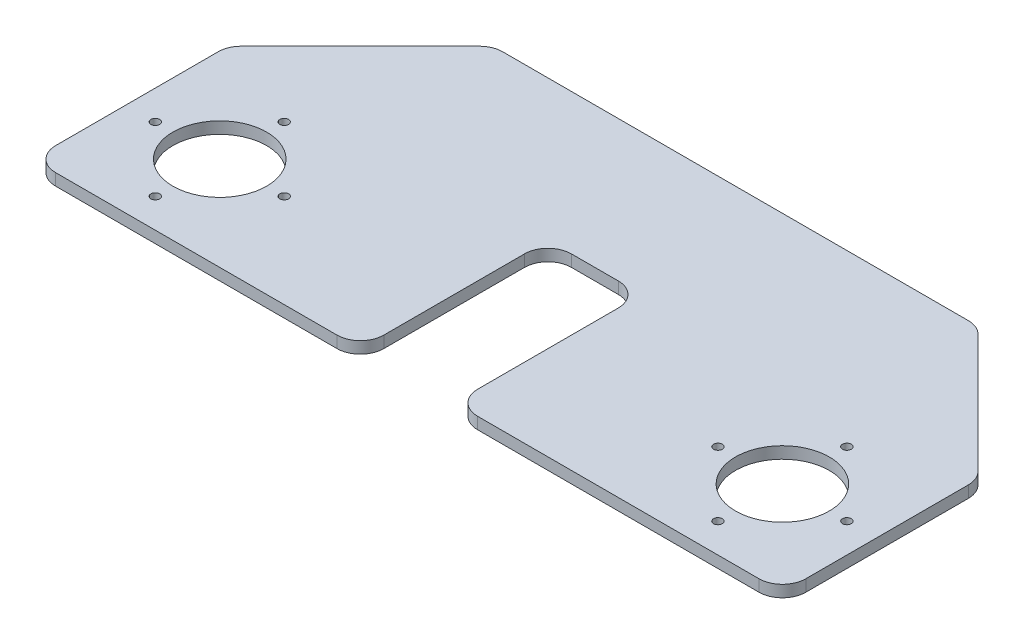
from build123d import *

# Parameters (mm, degrees)
BOSS_EXTRUDE1_DEPTH = 6.35
SKETCH2_R           = 25.4
CUT_EXTRUDE1_DEPTH  = 240.70724332
SKETCH3_R           = 2.3749
CUT_EXTRUDE2_DEPTH  = 6.35
FILLET1_R           = 12.7


with BuildPart() as part:
    # Sketch1 → Boss-Extrude1 (new body)
    with BuildSketch(Plane(origin=(0, 0, 0), x_dir=(1, 0, 0), z_dir=(0, 1, 0))):
        Polygon((-203.2, -50.8), (-25.4, -50.8), (-25.4, 50.8), (25.4, 50.8), (25.4, -50.8), (203.2, -50.8), (203.2, 55.157951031), (131.357951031, 127), (-131.357951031, 127), (-203.2, 55.157951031), align=None)
    extrude(amount=-BOSS_EXTRUDE1_DEPTH)

    # Sketch2 → Cut-Extrude1 (cut, through all)
    with BuildSketch(Plane(origin=(0, 0, 0), x_dir=(1, 0, 0), z_dir=(0, 1, 0))):
        with Locations(Location((-152.4, 0, 0), (0, 0, 270))):
            Circle(SKETCH2_R)
        with Locations(Location((152.4, 0, 0), (0, 0, 270))):
            Circle(SKETCH2_R)
    extrude(amount=-CUT_EXTRUDE1_DEPTH, mode=Mode.SUBTRACT)

    # Sketch3 → Cut-Extrude2 (cut)
    with BuildSketch(Plane(origin=(0, 0, 0), x_dir=(1, 0, 0), z_dir=(0, 1, 0))):
        with Locations(Location((-152.4, 34.925, 0), (0, 0, 270))):
            Circle(SKETCH3_R)
        with Locations(Location((-152.4, -34.925, 0), (0, 0, 270))):
            Circle(SKETCH3_R)
        with Locations(Location((-117.475, 0, 0), (0, 0, 270))):
            Circle(SKETCH3_R)
        with Locations(Location((-187.325, 0, 0), (0, 0, 270))):
            Circle(SKETCH3_R)
        with Locations(Location((117.475, 0, 0), (0, 0, 270))):
            Circle(SKETCH3_R)
        with Locations(Location((152.4, 34.925, 0), (0, 0, 270))):
            Circle(SKETCH3_R)
        with Locations(Location((187.325, 0, 0), (0, 0, 270))):
            Circle(SKETCH3_R)
        with Locations(Location((152.4, -34.925, 0), (0, 0, 270))):
            Circle(SKETCH3_R)
    extrude(amount=-CUT_EXTRUDE2_DEPTH, mode=Mode.SUBTRACT)

    # Fillet1
    fillet1_edges = [part.edges().sort_by_distance(p)[0] for p in [
        (-203.2, -3.175, -55.157951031),
        (-131.357951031, -3.175, -127),
        (131.357951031, -3.175, -127),
        (203.2, -3.175, -55.157951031),
        (203.2, -3.175, 50.8),
        (25.4, -3.175, 50.8),
        (25.4, -3.175, -50.8),
        (-25.4, -3.175, -50.8),
        (-25.4, -3.175, 50.8),
        (-203.2, -3.175, 50.8),
    ]]
    fillet(fillet1_edges, radius=FILLET1_R)


solid = part.part
